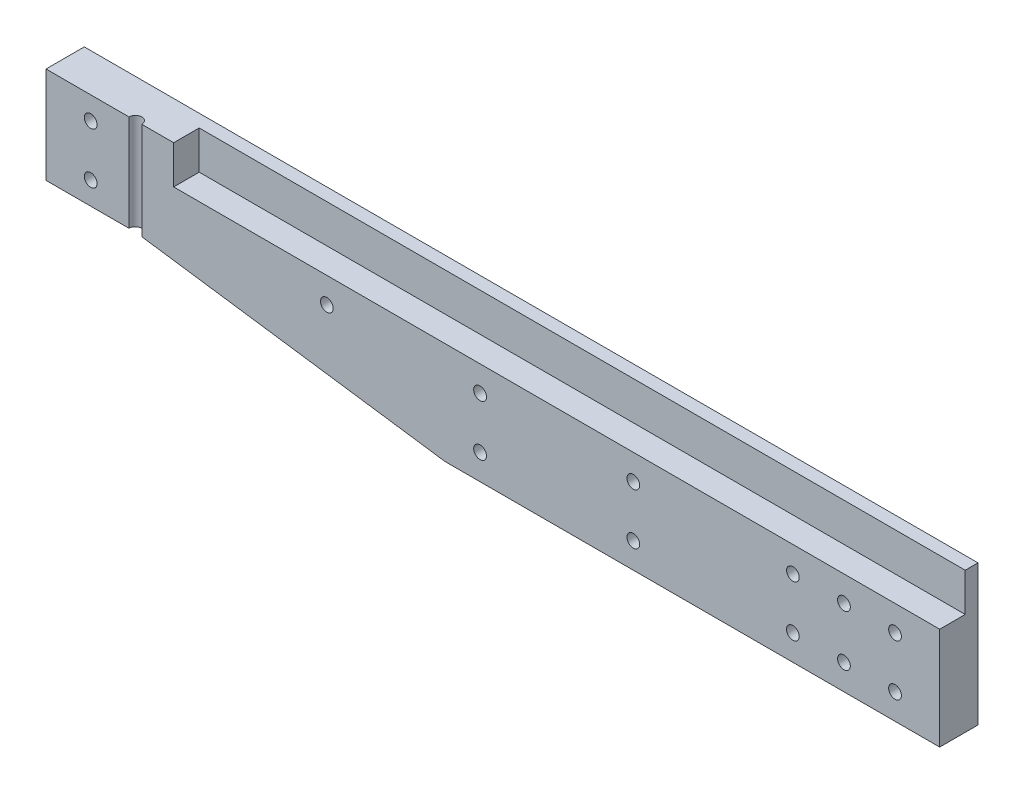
from build123d import *
from build123d.topology import SkipClean

# Parameters (mm, degrees)
SKETCH1_W               = 85.725
SKETCH1_H               = 2.54
BOSS_EXTRUDE1_DEPTH     = 69.85
CUT_EXTRUDE1_DEPTH      = 498.422296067
SKETCH3_W               = 12.7
SKETCH3_H               = 19.05
CUT_EXTRUDE2_DEPTH      = 381
CUT_EXTRUDE3_DEPTH      = 498.422296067
CUT_EXTRUDE3_DEPTH_BACK = 498.422296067
SKETCH5_W               = 19.05
SKETCH5_H               = 47.993709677
BOSS_EXTRUDE2_DEPTH     = 44.45
CUT_EXTRUDE5_REACH      = 452.358
SKETCH8_R               = 3.175
CUT_EXTRUDE6_REACH      = 452.358
SKETCH9_R               = 3.175
SKETCH9_R_2             = 3.1496
CUT_EXTRUDE7_DEPTH      = 499.515444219
CUT_EXTRUDE7_DEPTH_BACK = 499.515444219
CUT_EXTRUDE8_DEPTH      = 498.422296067
CUT_EXTRUDE8_DEPTH_BACK = 498.422296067
CUT_EXTRUDE9_REACH      = 452.358
SKETCH12_R              = 3.175


with BuildPart() as part:
    # Sketch1 → Boss-Extrude1 (new body)
    with BuildSketch(Plane(origin=(0, 0, 0), x_dir=(1, 0, 0), z_dir=(0, 1, 0))):
        with Locations((-68.2625, 1.27)):
            Rectangle(SKETCH1_W, SKETCH1_H)
        Polygon((-111.125, 2.54), (-25.4, 2.54), (-25.4, 0), (0, 0), (0, 19.05), (-25.4, 19.05), (-492.125, 19.05), (-492.125, 0), (-111.125, 0), align=None)
    boss_extrude1 = extrude(amount=BOSS_EXTRUDE1_DEPTH)

    # Sketch2 → Cut-Extrude1 (cut, symmetric)
    with BuildSketch(Plane.XY):
        Polygon((-1478.95977109, 174.991870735), (-492.125, 34.925), (-246.0625, 0), (740.77227109, -140.066870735), (460.638529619, -2113.736412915), (-1759.09351256, -1798.677671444), align=None)
    cut_extrude1 = extrude(amount=CUT_EXTRUDE1_DEPTH, both=True, mode=Mode.SUBTRACT)

    # Sketch3 → Cut-Extrude2 (cut)
    with BuildSketch(Plane(origin=(0, 0, 0), x_dir=(0, 0, -1), z_dir=(1, 0, 0))):
        with Locations((12.7, 60.325)):
            Rectangle(SKETCH3_W, SKETCH3_H)
    cut_extrude2 = extrude(amount=-CUT_EXTRUDE2_DEPTH, mode=Mode.SUBTRACT)

    # Sketch4 → Cut-Extrude3 (cut, two sides: drawn at the far end of the back side and taken through both)
    with BuildSketch(Plane(origin=(0, 69.85, 0), x_dir=(-1, 0, 0), z_dir=(0, 1, 0)).offset(-CUT_EXTRUDE3_DEPTH_BACK)):
        Polygon((400.05, 811.006629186), (400.05, 0), (400.05, -19.05), (400.05, -830.056629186), (2022.063258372, -830.056629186), (2022.063258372, 811.006629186), align=None)
    extrude(amount=CUT_EXTRUDE3_DEPTH + CUT_EXTRUDE3_DEPTH_BACK, mode=Mode.SUBTRACT)

    # Sketch5 → Boss-Extrude2 (add)
    with BuildSketch(Plane.ZY.offset(400.05)):
        with Locations((-9.525, 45.853145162)):
            Rectangle(SKETCH5_W, SKETCH5_H)
    boss_extrude2 = extrude(amount=BOSS_EXTRUDE2_DEPTH)

    # Sketch8 → Cut-Extrude5 (cut, up to next)
    with BuildSketch(Plane(origin=(0, 69.85, 0), x_dir=(1, 0, 0), z_dir=(0, 1, 0)), mode=Mode.PRIVATE) as cut_extrude5_sk1:
        with Locations((-400.05, 19.05)):
            Circle(SKETCH8_R)
    cut_extrude5_tool1 = extrude(cut_extrude5_sk1.sketch, amount=-CUT_EXTRUDE5_REACH, mode=Mode.PRIVATE) & part.part
    cut_extrude5 = cut_extrude5_tool1.solids().sort_by_distance((-400.05, 69.85, -19.05))[0]
    add(cut_extrude5, mode=Mode.SUBTRACT)

    # Sketch9 → Cut-Extrude6 (cut, up to next)
    with BuildSketch(Plane.XY, mode=Mode.PRIVATE) as cut_extrude6_sk1:
        with Locations((-22.225, 38.1)):
            Circle(SKETCH9_R)
    cut_extrude6_tool1 = extrude(cut_extrude6_sk1.sketch, amount=-CUT_EXTRUDE6_REACH, mode=Mode.PRIVATE) & part.part
    # Sketch9 → Cut-Extrude6 (cut, up to next)
    with BuildSketch(Plane.XY, mode=Mode.PRIVATE) as cut_extrude6_sk2:
        with Locations((-22.225, 12.7)):
            Circle(SKETCH9_R)
    cut_extrude6_tool2 = extrude(cut_extrude6_sk2.sketch, amount=-CUT_EXTRUDE6_REACH, mode=Mode.PRIVATE) & part.part
    # Sketch9 → Cut-Extrude6 (cut, up to next)
    with BuildSketch(Plane.XY, mode=Mode.PRIVATE) as cut_extrude6_sk3:
        with Locations((-152.4, 12.7)):
            Circle(SKETCH9_R)
    cut_extrude6_tool3 = extrude(cut_extrude6_sk3.sketch, amount=-CUT_EXTRUDE6_REACH, mode=Mode.PRIVATE) & part.part
    # Sketch9 → Cut-Extrude6 (cut, up to next)
    with BuildSketch(Plane.XY, mode=Mode.PRIVATE) as cut_extrude6_sk4:
        with Locations((-228.6, 12.7)):
            Circle(SKETCH9_R)
    cut_extrude6_tool4 = extrude(cut_extrude6_sk4.sketch, amount=-CUT_EXTRUDE6_REACH, mode=Mode.PRIVATE) & part.part
    # Sketch9 → Cut-Extrude6 (cut, up to next)
    with BuildSketch(Plane.XY, mode=Mode.PRIVATE) as cut_extrude6_sk5:
        with Locations((-304.8, 38.1)):
            Circle(SKETCH9_R)
    cut_extrude6_tool5 = extrude(cut_extrude6_sk5.sketch, amount=-CUT_EXTRUDE6_REACH, mode=Mode.PRIVATE) & part.part
    # Sketch9 → Cut-Extrude6 (cut, up to next)
    with BuildSketch(Plane.XY, mode=Mode.PRIVATE) as cut_extrude6_sk6:
        with Locations((-228.6, 38.1)):
            Circle(SKETCH9_R)
    cut_extrude6_tool6 = extrude(cut_extrude6_sk6.sketch, amount=-CUT_EXTRUDE6_REACH, mode=Mode.PRIVATE) & part.part
    # Sketch9 → Cut-Extrude6 (cut, up to next)
    with BuildSketch(Plane.XY, mode=Mode.PRIVATE) as cut_extrude6_sk7:
        with Locations((-152.4, 38.1)):
            Circle(SKETCH9_R)
    cut_extrude6_tool7 = extrude(cut_extrude6_sk7.sketch, amount=-CUT_EXTRUDE6_REACH, mode=Mode.PRIVATE) & part.part
    # Sketch9 → Cut-Extrude6 (cut, up to next)
    with BuildSketch(Plane.XY, mode=Mode.PRIVATE) as cut_extrude6_sk8:
        with Locations((-73.025, 12.7)):
            Circle(SKETCH9_R)
    cut_extrude6_tool8 = extrude(cut_extrude6_sk8.sketch, amount=-CUT_EXTRUDE6_REACH, mode=Mode.PRIVATE) & part.part
    # Sketch9 → Cut-Extrude6 (cut, up to next)
    with BuildSketch(Plane.XY, mode=Mode.PRIVATE) as cut_extrude6_sk9:
        with Locations((-73.025, 38.1)):
            Circle(SKETCH9_R_2)
    cut_extrude6_tool9 = extrude(cut_extrude6_sk9.sketch, amount=-CUT_EXTRUDE6_REACH, mode=Mode.PRIVATE) & part.part
    # Sketch9 → Cut-Extrude6 (cut, up to next)
    with BuildSketch(Plane.XY, mode=Mode.PRIVATE) as cut_extrude6_sk10:
        with Locations((-47.625, 38.1)):
            Circle(SKETCH9_R)
    cut_extrude6_tool10 = extrude(cut_extrude6_sk10.sketch, amount=-CUT_EXTRUDE6_REACH, mode=Mode.PRIVATE) & part.part
    # Sketch9 → Cut-Extrude6 (cut, up to next)
    with BuildSketch(Plane.XY, mode=Mode.PRIVATE) as cut_extrude6_sk11:
        with Locations((-47.625, 12.7)):
            Circle(SKETCH9_R)
    cut_extrude6_tool11 = extrude(cut_extrude6_sk11.sketch, amount=-CUT_EXTRUDE6_REACH, mode=Mode.PRIVATE) & part.part
    cut_extrude6_1 = cut_extrude6_tool1.solids().sort_by_distance((-22.225, 38.1, 0))[0]
    add(cut_extrude6_1, mode=Mode.SUBTRACT)
    cut_extrude6_2 = cut_extrude6_tool2.solids().sort_by_distance((-22.225, 12.7, 0))[0]
    add(cut_extrude6_2, mode=Mode.SUBTRACT)
    cut_extrude6_3 = cut_extrude6_tool3.solids().sort_by_distance((-152.4, 12.7, 0))[0]
    add(cut_extrude6_3, mode=Mode.SUBTRACT)
    cut_extrude6_4 = cut_extrude6_tool4.solids().sort_by_distance((-228.6, 12.7, 0))[0]
    add(cut_extrude6_4, mode=Mode.SUBTRACT)
    cut_extrude6_5 = cut_extrude6_tool5.solids().sort_by_distance((-304.8, 38.1, 0))[0]
    add(cut_extrude6_5, mode=Mode.SUBTRACT)
    cut_extrude6_6 = cut_extrude6_tool6.solids().sort_by_distance((-228.6, 38.1, 0))[0]
    add(cut_extrude6_6, mode=Mode.SUBTRACT)
    cut_extrude6_7 = cut_extrude6_tool7.solids().sort_by_distance((-152.4, 38.1, 0))[0]
    add(cut_extrude6_7, mode=Mode.SUBTRACT)
    cut_extrude6_8 = cut_extrude6_tool8.solids().sort_by_distance((-73.025, 12.7, 0))[0]
    add(cut_extrude6_8, mode=Mode.SUBTRACT)
    cut_extrude6_9 = cut_extrude6_tool9.solids().sort_by_distance((-73.025, 38.1, 0))[0]
    add(cut_extrude6_9, mode=Mode.SUBTRACT)
    cut_extrude6_10 = cut_extrude6_tool10.solids().sort_by_distance((-47.625, 38.1, 0))[0]
    add(cut_extrude6_10, mode=Mode.SUBTRACT)
    cut_extrude6_11 = cut_extrude6_tool11.solids().sort_by_distance((-47.625, 12.7, 0))[0]
    add(cut_extrude6_11, mode=Mode.SUBTRACT)
    cut_extrude6 = cut_extrude6_1 + cut_extrude6_2 + cut_extrude6_3 + cut_extrude6_4 + cut_extrude6_5 + cut_extrude6_6 + cut_extrude6_7 + cut_extrude6_8 + cut_extrude6_9 + cut_extrude6_10 + cut_extrude6_11  # Cut-Extrude6 as one shape, for the pattern or mirror that repeats it

    # Mirror1: Boss-Extrude1, Cut-Extrude1, Cut-Extrude2, Boss-Extrude2, Cut-Extrude5, Cut-Extrude6 across plane
    with SkipClean():  # the faces are left unmerged after this step: merging them gives an invalid solid
        add(boss_extrude1.mirror(Plane(origin=(-629.274019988, 69.85, -19.05), x_dir=(1, 0, 0), z_dir=(0, 0, 1))))
        add(cut_extrude1.mirror(Plane(origin=(-629.274019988, 69.85, -19.05), x_dir=(1, 0, 0), z_dir=(0, 0, 1))), mode=Mode.SUBTRACT)
        add(cut_extrude2.mirror(Plane(origin=(-629.274019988, 69.85, -19.05), x_dir=(1, 0, 0), z_dir=(0, 0, 1))), mode=Mode.SUBTRACT)
        add(boss_extrude2.mirror(Plane(origin=(-629.274019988, 69.85, -19.05), x_dir=(1, 0, 0), z_dir=(0, 0, 1))))
        add(cut_extrude5.mirror(Plane(origin=(-629.274019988, 69.85, -19.05), x_dir=(1, 0, 0), z_dir=(0, 0, 1))), mode=Mode.SUBTRACT)
        add(cut_extrude6.mirror(Plane(origin=(-629.274019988, 69.85, -19.05), x_dir=(1, 0, 0), z_dir=(0, 0, 1))), mode=Mode.SUBTRACT)

    # Sketch10 → Cut-Extrude7 (cut, two sides: drawn at the far end of the back side and taken through both)
    with BuildSketch(Plane(origin=(0, 69.85, 0), x_dir=(-1, 0, 0), z_dir=(0, 1, 0)).offset(-CUT_EXTRUDE7_DEPTH_BACK)):
        Polygon((1690.997314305, -19.05), (444.5, -19.05), (-125.830095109, -19.05), (-1372.327409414, -19.05), (-1372.327409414, 2473.944628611), (1690.997314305, 2473.944628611), align=None)
    extrude(amount=CUT_EXTRUDE7_DEPTH + CUT_EXTRUDE7_DEPTH_BACK, mode=Mode.SUBTRACT)

    # Sketch11 → Cut-Extrude8 (cut, two sides: drawn at the far end of the back side and taken through both)
    with BuildSketch(Plane.XY.offset(-19.05).offset(-CUT_EXTRUDE8_DEPTH_BACK)):
        Polygon((-444.5, -881.744167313), (-444.5, 28.165322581), (-444.5, 69.85), (-444.5, 979.759489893), (-2264.318979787, 979.759489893), (-2264.318979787, -881.744167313), align=None)
    extrude(amount=CUT_EXTRUDE8_DEPTH + CUT_EXTRUDE8_DEPTH_BACK, mode=Mode.SUBTRACT)

    # Sketch12 → Cut-Extrude9 (cut, up to next)
    with BuildSketch(Plane(origin=(0, 0, -38.1), x_dir=(-1, 0, 0), z_dir=(0, 0, -1)), mode=Mode.PRIVATE) as cut_extrude9_sk1:
        with Locations((422.275, 58.553145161)):
            Circle(SKETCH12_R)
    cut_extrude9_tool1 = extrude(cut_extrude9_sk1.sketch, amount=-CUT_EXTRUDE9_REACH, mode=Mode.PRIVATE) & part.part
    # Sketch12 → Cut-Extrude9 (cut, up to next)
    with BuildSketch(Plane(origin=(0, 0, -38.1), x_dir=(-1, 0, 0), z_dir=(0, 0, -1)), mode=Mode.PRIVATE) as cut_extrude9_sk2:
        with Locations((422.275, 33.153145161)):
            Circle(SKETCH12_R)
    cut_extrude9_tool2 = extrude(cut_extrude9_sk2.sketch, amount=-CUT_EXTRUDE9_REACH, mode=Mode.PRIVATE) & part.part
    add(cut_extrude9_tool1.solids().sort_by_distance((-422.275, 58.553145, -38.1))[0], mode=Mode.SUBTRACT)
    add(cut_extrude9_tool2.solids().sort_by_distance((-422.275, 33.153145, -38.1))[0], mode=Mode.SUBTRACT)


solid = part.part
